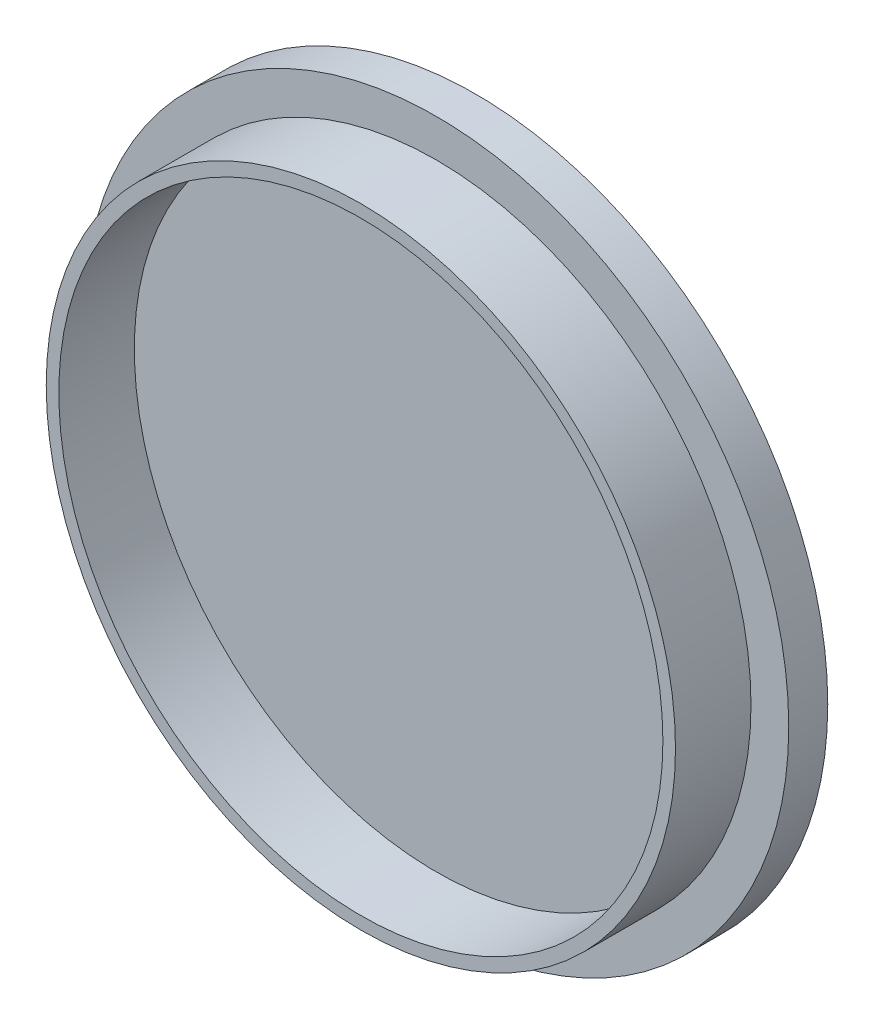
from build123d import *

# Parameters (mm, degrees)
ESQUISSE1_R          = 28
BASE_EXTRUSION_DEPTH = 3.1
ESQUISSE2_R          = 25
ESQUISSE2_R_2        = 24
BOSS_EXTRU_1_DEPTH   = 6


with BuildPart() as part:
    # Esquisse1 → Base-Extrusion (new body)
    with BuildSketch(Plane.XY):
        with Locations(Location((0, 0, 0), (0, 0, 180))):
            Circle(ESQUISSE1_R)
    extrude(amount=BASE_EXTRUSION_DEPTH)

    # Esquisse2 → Boss.-Extru.1 (add)
    with BuildSketch(Plane.XY.offset(3.1)):
        Circle(ESQUISSE2_R)
        Circle(ESQUISSE2_R_2, mode=Mode.SUBTRACT)
    extrude(amount=BOSS_EXTRU_1_DEPTH)


solid = part.part
